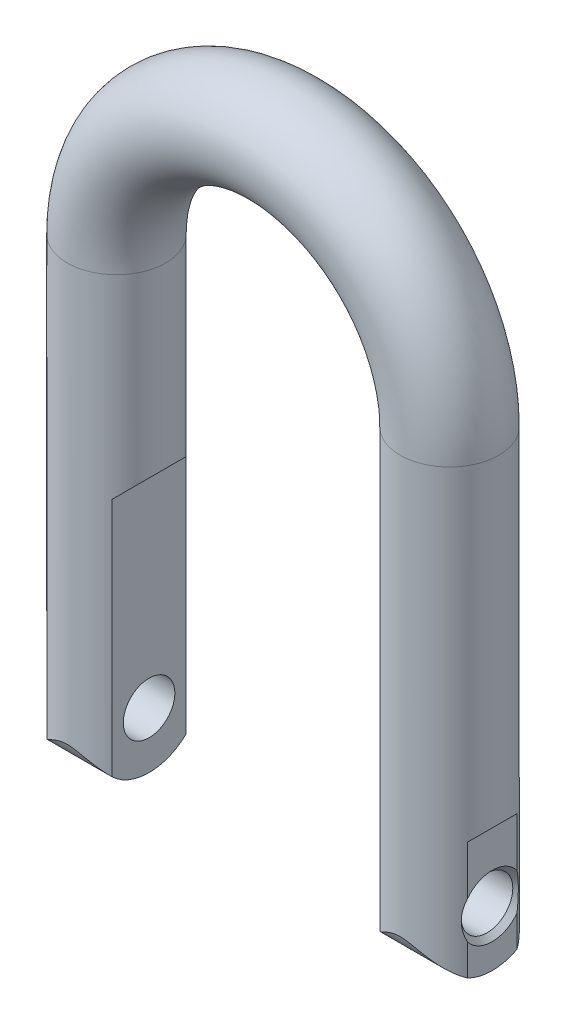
ISO-10303-21;
HEADER;
FILE_DESCRIPTION(('STEP AP214'),'2;1');
FILE_NAME('part.step','',(''),(''),'','','');
FILE_SCHEMA(('AUTOMOTIVE_DESIGN { 1 0 10303 214 1 1 1 1 }'));
ENDSEC;
DATA;
#1=APPLICATION_CONTEXT('core data for automotive mechanical design processes');
#2=APPLICATION_PROTOCOL_DEFINITION('international standard','automotive_design',2000,#1);
#3=PRODUCT_CONTEXT('',#1,'mechanical');
#4=PRODUCT('Part','Part','',(#3));
#5=PRODUCT_RELATED_PRODUCT_CATEGORY('part','',(#4));
#6=PRODUCT_DEFINITION_FORMATION('','',#4);
#7=PRODUCT_DEFINITION_CONTEXT('part definition',#1,'design');
#8=PRODUCT_DEFINITION('design','',#6,#7);
#9=PRODUCT_DEFINITION_SHAPE('','',#8);
#10=(LENGTH_UNIT() NAMED_UNIT(*) SI_UNIT(.MILLI.,.METRE.));
#11=(NAMED_UNIT(*) PLANE_ANGLE_UNIT() SI_UNIT($,.RADIAN.));
#12=(NAMED_UNIT(*) SI_UNIT($,.STERADIAN.) SOLID_ANGLE_UNIT());
#13=UNCERTAINTY_MEASURE_WITH_UNIT(LENGTH_MEASURE(1.E-05),#10,'distance_accuracy_value','');
#14=(GEOMETRIC_REPRESENTATION_CONTEXT(3) GLOBAL_UNCERTAINTY_ASSIGNED_CONTEXT((#13)) GLOBAL_UNIT_ASSIGNED_CONTEXT((#10,
#11,#12)) REPRESENTATION_CONTEXT('',''));
#15=CARTESIAN_POINT('',(0.,0.,0.));
#16=DIRECTION('',(0.,0.,1.));
#17=DIRECTION('',(1.,0.,0.));
#18=AXIS2_PLACEMENT_3D('',#15,#16,#17);
#19=CARTESIAN_POINT('',(20.193,-31.4833,-76.2));
#20=DIRECTION('',(-1.,0.,0.));
#21=DIRECTION('',(0.,-1.,0.));
#22=AXIS2_PLACEMENT_3D('',#19,#20,#21);
#23=PLANE('',#22);
#24=DIRECTION('',(0.,-1.,0.));
#25=VECTOR('',#24,1.);
#26=CARTESIAN_POINT('',(20.193,0.,2.39787973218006));
#27=LINE('',#26,#25);
#28=CARTESIAN_POINT('',(20.193,-31.4833,2.39787973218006));
#29=VERTEX_POINT('',#28);
#30=CARTESIAN_POINT('',(20.193,-36.2341889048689,2.39787973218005));
#31=VERTEX_POINT('',#30);
#32=EDGE_CURVE('E264',#29,#31,#27,.T.);
#33=ORIENTED_EDGE('',*,*,#32,.T.);
#34=CARTESIAN_POINT('',(20.193,-38.0111,0.));
#35=DIRECTION('',(1.,0.,0.));
#36=DIRECTION('',(0.,0.,-1.));
#37=AXIS2_PLACEMENT_3D('',#34,#35,#36);
#38=CIRCLE('',#37,2.9845);
#39=CARTESIAN_POINT('',(20.193,-36.2341889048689,-2.39787973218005));
#40=VERTEX_POINT('',#39);
#41=EDGE_CURVE('E265',#40,#31,#38,.T.);
#42=ORIENTED_EDGE('',*,*,#41,.F.);
#43=DIRECTION('',(0.,-1.,0.));
#44=VECTOR('',#43,1.);
#45=CARTESIAN_POINT('',(20.193,0.,-2.39787973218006));
#46=LINE('',#45,#44);
#47=CARTESIAN_POINT('',(20.193,-31.4833,-2.39787973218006));
#48=VERTEX_POINT('',#47);
#49=EDGE_CURVE('E272',#40,#48,#46,.F.);
#50=ORIENTED_EDGE('',*,*,#49,.T.);
#51=DIRECTION('',(0.,0.,1.));
#52=VECTOR('',#51,1.);
#53=CARTESIAN_POINT('',(20.193,-31.4833,-76.2));
#54=LINE('',#53,#52);
#55=EDGE_CURVE('E268',#48,#29,#54,.T.);
#56=ORIENTED_EDGE('',*,*,#55,.T.);
#57=EDGE_LOOP('',(#33,#42,#50,#56));
#58=FACE_BOUND('',#57,.T.);
#59=ADVANCED_FACE('F29',(#58),#23,.F.);
#60=CARTESIAN_POINT('',(-20.193,-31.4833,-76.2));
#61=DIRECTION('',(1.,0.,0.));
#62=DIRECTION('',(0.,0.,-1.));
#63=AXIS2_PLACEMENT_3D('',#60,#61,#62);
#64=PLANE('',#63);
#65=DIRECTION('',(0.,-1.,0.));
#66=VECTOR('',#65,1.);
#67=CARTESIAN_POINT('',(-20.193,0.,-2.39787973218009));
#68=LINE('',#67,#66);
#69=CARTESIAN_POINT('',(-20.193,-37.3430510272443,-2.39787973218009));
#70=VERTEX_POINT('',#69);
#71=CARTESIAN_POINT('',(-20.193,-31.4833,-2.39787973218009));
#72=VERTEX_POINT('',#71);
#73=EDGE_CURVE('E148',#70,#72,#68,.F.);
#74=ORIENTED_EDGE('',*,*,#73,.F.);
#75=CARTESIAN_POINT('',(-20.193,-38.0111,0.));
#76=DIRECTION('',(1.,0.,0.));
#77=DIRECTION('',(0.,0.,-1.));
#78=AXIS2_PLACEMENT_3D('',#75,#76,#77);
#79=CIRCLE('',#78,2.4892);
#80=CARTESIAN_POINT('',(-20.193,-37.3430510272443,2.39787973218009));
#81=VERTEX_POINT('',#80);
#82=EDGE_CURVE('E128',#70,#81,#79,.T.);
#83=ORIENTED_EDGE('',*,*,#82,.T.);
#84=DIRECTION('',(0.,-1.,0.));
#85=VECTOR('',#84,1.);
#86=CARTESIAN_POINT('',(-20.193,0.,2.39787973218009));
#87=LINE('',#86,#85);
#88=CARTESIAN_POINT('',(-20.193,-31.4833,2.39787973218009));
#89=VERTEX_POINT('',#88);
#90=EDGE_CURVE('E138',#89,#81,#87,.T.);
#91=ORIENTED_EDGE('',*,*,#90,.F.);
#92=DIRECTION('',(0.,0.,1.));
#93=VECTOR('',#92,1.);
#94=CARTESIAN_POINT('',(-20.193,-31.4833,-76.2));
#95=LINE('',#94,#93);
#96=EDGE_CURVE('E280',#72,#89,#95,.T.);
#97=ORIENTED_EDGE('',*,*,#96,.F.);
#98=EDGE_LOOP('',(#74,#83,#91,#97));
#99=FACE_BOUND('',#98,.T.);
#100=ADVANCED_FACE('F235',(#99),#64,.F.);
#101=CARTESIAN_POINT('',(16.0782,0.,0.));
#102=DIRECTION('',(0.,-1.,0.));
#103=DIRECTION('',(1.,0.,0.));
#104=AXIS2_PLACEMENT_3D('',#101,#102,#103);
#105=CYLINDRICAL_SURFACE('',#104,4.7625);
#106=CARTESIAN_POINT('',(20.4463472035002,-35.3875607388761,1.89755006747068));
#107=CARTESIAN_POINT('',(20.4242410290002,-35.4516474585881,1.94842537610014));
#108=CARTESIAN_POINT('',(20.4021202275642,-35.5175683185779,1.99692815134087));
#109=CARTESIAN_POINT('',(20.3582674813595,-35.6526684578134,2.08927063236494));
#110=CARTESIAN_POINT('',(20.3365353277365,-35.7218459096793,2.13311290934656));
#111=CARTESIAN_POINT('',(20.2724434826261,-35.9339830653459,2.25798432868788));
#112=CARTESIAN_POINT('',(20.2312610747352,-36.0813420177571,2.33219741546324));
#113=CARTESIAN_POINT('',(20.1417011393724,-36.4391198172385,2.48594409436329));
#114=CARTESIAN_POINT('',(20.0959167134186,-36.6534341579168,2.55810545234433));
#115=CARTESIAN_POINT('',(20.0409778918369,-36.9831686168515,2.64175388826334));
#116=CARTESIAN_POINT('',(20.0249501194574,-37.0945136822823,2.66554336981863));
#117=CARTESIAN_POINT('',(19.9981198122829,-37.3193048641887,2.70485039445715));
#118=CARTESIAN_POINT('',(19.9873168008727,-37.4327507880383,2.72036869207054));
#119=CARTESIAN_POINT('',(19.9715199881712,-37.6597444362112,2.74292749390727));
#120=CARTESIAN_POINT('',(19.9664700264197,-37.7732801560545,2.75004998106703));
#121=CARTESIAN_POINT('',(19.9622209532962,-38.0006870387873,2.7560482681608));
#122=CARTESIAN_POINT('',(19.9630221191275,-38.1145582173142,2.75492367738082));
#123=CARTESIAN_POINT('',(19.9704361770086,-38.3416036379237,2.74443894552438));
#124=CARTESIAN_POINT('',(19.9770425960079,-38.4547785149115,2.73508797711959));
#125=CARTESIAN_POINT('',(19.995745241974,-38.6796590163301,2.70822959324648));
#126=CARTESIAN_POINT('',(20.0078404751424,-38.7913649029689,2.69072365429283));
#127=CARTESIAN_POINT('',(20.0426244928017,-39.0551965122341,2.63933032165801));
#128=CARTESIAN_POINT('',(20.0675992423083,-39.2063168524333,2.60173028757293));
#129=CARTESIAN_POINT('',(20.1252066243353,-39.5025405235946,2.511175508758));
#130=CARTESIAN_POINT('',(20.1578499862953,-39.6476350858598,2.45819922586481));
#131=CARTESIAN_POINT('',(20.2431410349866,-39.9882560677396,2.31183470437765));
#132=CARTESIAN_POINT('',(20.2984842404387,-40.1798789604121,2.21079163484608));
#133=CARTESIAN_POINT('',(20.412844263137,-40.54123031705,1.9771462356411));
#134=CARTESIAN_POINT('',(20.4718488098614,-40.7110266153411,1.84464551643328));
#135=CARTESIAN_POINT('',(20.5501235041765,-40.9241143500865,1.63918948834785));
#136=CARTESIAN_POINT('',(20.5713200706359,-40.9804998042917,1.58033562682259));
#137=CARTESIAN_POINT('',(20.6125679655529,-41.0882437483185,1.45776982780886));
#138=CARTESIAN_POINT('',(20.632618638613,-41.1395993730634,1.39405515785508));
#139=CARTESIAN_POINT('',(20.6518347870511,-41.1880928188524,1.32788218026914));
#140=B_SPLINE_CURVE_WITH_KNOTS('',3,(#106,#107,#108,#109,#110,#111,#112,#113,#114,#115,#116,
#117,#118,#119,#120,#121,#122,#123,#124,#125,#126,#127,#128,#129,#130,#131,#132,#133,#134,#135,
#136,#137,#138,#139),.UNSPECIFIED.,.F.,.F.,(4,2,2,2,2,2,2,2,2,2,2,2,2,2,2,2,4),(0.,
0.254168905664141,0.508196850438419,1.01705863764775,1.70557840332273,2.05017516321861,
2.39474048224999,2.73591257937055,3.07710083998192,3.41790914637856,3.75865577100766,
4.23066016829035,4.70332893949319,5.37109579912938,6.03673438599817,6.2891290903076,
6.54166673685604),.UNSPECIFIED.);
#141=CARTESIAN_POINT('',(20.193,-39.7880110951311,2.39787973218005));
#142=VERTEX_POINT('',#141);
#143=EDGE_CURVE('E11',#31,#142,#140,.T.);
#144=ORIENTED_EDGE('',*,*,#143,.F.);
#145=ORIENTED_EDGE('',*,*,#32,.F.);
#146=CARTESIAN_POINT('',(16.0782,-35.5981,0.));
#147=DIRECTION('',(-0.707106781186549,0.707106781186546,0.));
#148=DIRECTION('',(-0.707106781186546,-0.707106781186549,0.));
#149=AXIS2_PLACEMENT_3D('',#146,#147,#148);
#150=ELLIPSE('',#149,6.73519209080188,4.7625);
#151=EDGE_CURVE('E129',#48,#29,#150,.F.);
#152=ORIENTED_EDGE('',*,*,#151,.F.);
#153=ORIENTED_EDGE('',*,*,#49,.F.);
#154=CARTESIAN_POINT('',(20.6518347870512,-41.1880928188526,-1.32788218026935));
#155=CARTESIAN_POINT('',(20.632224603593,-41.1386036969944,-1.39540495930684));
#156=CARTESIAN_POINT('',(20.6117492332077,-41.0861457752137,-1.46036611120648));
#157=CARTESIAN_POINT('',(20.5696203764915,-40.9760167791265,-1.58521241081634));
#158=CARTESIAN_POINT('',(20.5479678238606,-40.9183498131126,-1.64510148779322));
#159=CARTESIAN_POINT('',(20.482337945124,-40.7393558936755,-1.81656037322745));
#160=CARTESIAN_POINT('',(20.4373921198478,-40.6113070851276,-1.92088562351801));
#161=CARTESIAN_POINT('',(20.3823503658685,-40.4438923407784,-2.03871061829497));
#162=CARTESIAN_POINT('',(20.3716097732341,-40.4107100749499,-2.06122111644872));
#163=CARTESIAN_POINT('',(20.3314239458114,-40.2844241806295,-2.14383990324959));
#164=CARTESIAN_POINT('',(20.3023647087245,-40.1887518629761,-2.20031307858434));
#165=CARTESIAN_POINT('',(20.2461284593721,-39.9923916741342,-2.30506118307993));
#166=CARTESIAN_POINT('',(20.2189544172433,-39.89169629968,-2.35332334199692));
#167=CARTESIAN_POINT('',(20.1417421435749,-39.5832410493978,-2.4858752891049));
#168=CARTESIAN_POINT('',(20.0959515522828,-39.368925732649,-2.55805010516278));
#169=CARTESIAN_POINT('',(20.040999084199,-39.0391833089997,-2.64172274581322));
#170=CARTESIAN_POINT('',(20.0249619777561,-38.9277832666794,-2.66552604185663));
#171=CARTESIAN_POINT('',(19.9981227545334,-38.702922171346,-2.70484604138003));
#172=CARTESIAN_POINT('',(19.9873178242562,-38.5894622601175,-2.72036719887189));
#173=CARTESIAN_POINT('',(19.9715218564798,-38.3624840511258,-2.74292485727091));
#174=CARTESIAN_POINT('',(19.9664725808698,-38.2489781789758,-2.75004637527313));
#175=CARTESIAN_POINT('',(19.9622216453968,-38.0216283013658,-2.75604729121));
#176=CARTESIAN_POINT('',(19.9630203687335,-37.9077842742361,-2.75492614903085));
#177=CARTESIAN_POINT('',(19.9704286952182,-37.6807367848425,-2.74444952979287));
#178=CARTESIAN_POINT('',(19.9770346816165,-37.5675329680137,-2.73509917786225));
#179=CARTESIAN_POINT('',(19.9957393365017,-37.3425956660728,-2.70823823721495));
#180=CARTESIAN_POINT('',(20.0078369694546,-37.2308619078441,-2.6907291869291));
#181=CARTESIAN_POINT('',(20.0426459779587,-36.9668402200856,-2.63929808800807));
#182=CARTESIAN_POINT('',(20.0676521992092,-36.8155621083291,-2.60164839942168));
#183=CARTESIAN_POINT('',(20.1252768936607,-36.5193471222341,-2.51106371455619));
#184=CARTESIAN_POINT('',(20.1578898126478,-36.3744057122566,-2.45813986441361));
#185=CARTESIAN_POINT('',(20.231195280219,-36.0816510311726,-2.33232466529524));
#186=CARTESIAN_POINT('',(20.2723136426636,-35.9344575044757,-2.25822096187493));
#187=CARTESIAN_POINT('',(20.3363690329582,-35.7223741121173,-2.13344501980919));
#188=CARTESIAN_POINT('',(20.3581359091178,-35.653077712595,-2.08954149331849));
#189=CARTESIAN_POINT('',(20.4020554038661,-35.5177641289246,-1.9970708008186));
#190=CARTESIAN_POINT('',(20.4242081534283,-35.4517480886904,-1.94850202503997));
#191=CARTESIAN_POINT('',(20.4463472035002,-35.3875607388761,-1.89755006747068));
#192=B_SPLINE_CURVE_WITH_KNOTS('',3,(#154,#155,#156,#157,#158,#159,#160,#161,#162,#163,#164,
#165,#166,#167,#168,#169,#170,#171,#172,#173,#174,#175,#176,#177,#178,#179,#180,#181,#182,#183,
#184,#185,#186,#187,#188,#189,#190,#191),.UNSPECIFIED.,.F.,.F.,(4,2,2,2,2,2,2,2,2,2,2,2,2,2,2,2,
2,2,4),(0.,0.257678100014,0.51515471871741,1.02641734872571,1.1509539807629,1.49491024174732,
1.8393966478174,2.52768758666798,2.87247614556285,3.21707909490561,3.55816336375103,
3.89926998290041,4.2401643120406,4.58099438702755,5.05350293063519,5.52566753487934,
6.03373695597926,6.28818808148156,6.54272732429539),.UNSPECIFIED.);
#193=CARTESIAN_POINT('',(20.193,-39.7880110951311,-2.39787973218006));
#194=VERTEX_POINT('',#193);
#195=EDGE_CURVE('E42',#194,#40,#192,.T.);
#196=ORIENTED_EDGE('',*,*,#195,.F.);
#197=CARTESIAN_POINT('',(20.193,-42.8301382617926,-2.39787973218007));
#198=VERTEX_POINT('',#197);
#199=EDGE_CURVE('E275',#198,#194,#46,.F.);
#200=ORIENTED_EDGE('',*,*,#199,.F.);
#201=CARTESIAN_POINT('',(20.8407,-43.4213,0.));
#202=CARTESIAN_POINT('',(20.8407031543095,-43.4213031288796,0.109435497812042));
#203=CARTESIAN_POINT('',(20.8369233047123,-43.4178128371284,0.21884290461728));
#204=CARTESIAN_POINT('',(20.8218888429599,-43.4039379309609,0.436739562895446));
#205=CARTESIAN_POINT('',(20.8106324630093,-43.3935516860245,0.545228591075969));
#206=CARTESIAN_POINT('',(20.7808572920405,-43.366102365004,0.760415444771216));
#207=CARTESIAN_POINT('',(20.762333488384,-43.3490346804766,0.867111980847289));
#208=CARTESIAN_POINT('',(20.7183676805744,-43.3085756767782,1.07789000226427));
#209=CARTESIAN_POINT('',(20.6929225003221,-43.285181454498,1.18197026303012));
#210=CARTESIAN_POINT('',(20.6357606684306,-43.2327132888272,1.38607316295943));
#211=CARTESIAN_POINT('',(20.6040897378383,-43.2036807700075,1.4861193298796));
#212=CARTESIAN_POINT('',(20.5348407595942,-43.1403303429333,1.68244041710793));
#213=CARTESIAN_POINT('',(20.4972605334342,-43.1060104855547,1.77871393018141));
#214=CARTESIAN_POINT('',(20.3764273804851,-42.9959357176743,2.06120238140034));
#215=CARTESIAN_POINT('',(20.2850451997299,-42.9130316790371,2.24121326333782));
#216=CARTESIAN_POINT('',(20.0439931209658,-42.6959441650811,2.65164135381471));
#217=CARTESIAN_POINT('',(19.8856712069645,-42.5545560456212,2.8731576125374));
#218=CARTESIAN_POINT('',(19.6281454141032,-42.3284714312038,3.17758717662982));
#219=CARTESIAN_POINT('',(19.5388075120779,-42.2506434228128,3.2745526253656));
#220=CARTESIAN_POINT('',(19.3540498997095,-42.0914214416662,3.45937390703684));
#221=CARTESIAN_POINT('',(19.2586309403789,-42.0100279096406,3.54723086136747));
#222=CARTESIAN_POINT('',(19.0598006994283,-41.8428066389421,3.71603299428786));
#223=CARTESIAN_POINT('',(18.9562500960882,-41.7569190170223,3.79675342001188));
#224=CARTESIAN_POINT('',(18.7435463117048,-41.5839190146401,3.94897968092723));
#225=CARTESIAN_POINT('',(18.6343928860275,-41.4968065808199,4.02048511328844));
#226=CARTESIAN_POINT('',(18.4106239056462,-41.3230209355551,4.15429628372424));
#227=CARTESIAN_POINT('',(18.2960181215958,-41.2363472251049,4.21661771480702));
#228=CARTESIAN_POINT('',(18.060769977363,-41.0652793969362,4.33220470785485));
#229=CARTESIAN_POINT('',(17.9401306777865,-40.9808841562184,4.38547480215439));
#230=CARTESIAN_POINT('',(17.6952914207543,-40.8194948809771,4.4814324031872));
#231=CARTESIAN_POINT('',(17.5712858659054,-40.7423597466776,4.52437454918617));
#232=CARTESIAN_POINT('',(17.3151422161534,-40.5970952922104,4.60100608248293));
#233=CARTESIAN_POINT('',(17.1830026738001,-40.5289675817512,4.63469381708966));
#234=CARTESIAN_POINT('',(16.9311845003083,-40.4185155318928,4.68695866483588));
#235=CARTESIAN_POINT('',(16.8129142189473,-40.3738041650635,4.70709385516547));
#236=CARTESIAN_POINT('',(16.5700923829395,-40.3021387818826,4.73859627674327));
#237=CARTESIAN_POINT('',(16.4455646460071,-40.2751222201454,4.74999441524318));
#238=CARTESIAN_POINT('',(16.2120545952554,-40.2469495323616,4.76182828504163));
#239=CARTESIAN_POINT('',(16.1035561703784,-40.2425110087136,4.76365667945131));
#240=CARTESIAN_POINT('',(15.8874335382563,-40.2515041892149,4.75990696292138));
#241=CARTESIAN_POINT('',(15.7798097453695,-40.264943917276,4.75432552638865));
#242=CARTESIAN_POINT('',(15.5341157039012,-40.3139862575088,4.73340622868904));
#243=CARTESIAN_POINT('',(15.3974640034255,-40.3553537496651,4.71549550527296));
#244=CARTESIAN_POINT('',(15.132430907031,-40.4558233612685,4.66960479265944));
#245=CARTESIAN_POINT('',(15.0040906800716,-40.5150066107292,4.64157862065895));
#246=CARTESIAN_POINT('',(14.7554231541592,-40.6436683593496,4.57691159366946));
#247=CARTESIAN_POINT('',(14.635083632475,-40.7131306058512,4.54028428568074));
#248=CARTESIAN_POINT('',(14.4007852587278,-40.8580257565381,4.45904405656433));
#249=CARTESIAN_POINT('',(14.2868328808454,-40.9334645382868,4.41442321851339));
#250=CARTESIAN_POINT('',(14.0642868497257,-41.0875563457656,4.31744182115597));
#251=CARTESIAN_POINT('',(13.9557013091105,-41.1662139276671,4.26506999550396));
#252=CARTESIAN_POINT('',(13.7435407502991,-41.3247275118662,4.15273067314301));
#253=CARTESIAN_POINT('',(13.6399639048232,-41.4045830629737,4.09276597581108));
#254=CARTESIAN_POINT('',(13.4239023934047,-41.5748840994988,3.95658076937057));
#255=CARTESIAN_POINT('',(13.3120915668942,-41.6653103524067,3.87925864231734));
#256=CARTESIAN_POINT('',(13.0946008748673,-41.8443572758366,3.71458676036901));
#257=CARTESIAN_POINT('',(12.9889224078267,-41.9329775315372,3.62723473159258));
#258=CARTESIAN_POINT('',(12.681960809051,-42.1936998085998,3.3500564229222));
#259=CARTESIAN_POINT('',(12.4901343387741,-42.3611631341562,3.14472343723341));
#260=CARTESIAN_POINT('',(12.1792885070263,-42.6362154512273,2.74383515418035));
#261=CARTESIAN_POINT('',(12.053651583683,-42.7487385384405,2.556784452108));
#262=CARTESIAN_POINT('',(11.8266518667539,-42.9534475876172,2.15828195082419));
#263=CARTESIAN_POINT('',(11.7252619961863,-43.0456562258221,1.94685776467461));
#264=CARTESIAN_POINT('',(11.566419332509,-43.190692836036,1.53794751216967));
#265=CARTESIAN_POINT('',(11.5045375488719,-43.2474565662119,1.34361889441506));
#266=CARTESIAN_POINT('',(11.4303489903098,-43.3156401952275,1.04380892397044));
#267=CARTESIAN_POINT('',(11.4087221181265,-43.3355438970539,0.942460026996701));
#268=CARTESIAN_POINT('',(11.3720190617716,-43.369347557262,0.737613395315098));
#269=CARTESIAN_POINT('',(11.3569402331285,-43.3832499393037,0.634116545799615));
#270=CARTESIAN_POINT('',(11.3335523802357,-43.4048214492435,0.425233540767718));
#271=CARTESIAN_POINT('',(11.3252745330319,-43.4124618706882,0.319840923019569));
#272=CARTESIAN_POINT('',(11.3157620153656,-43.4212424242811,0.108508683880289));
#273=CARTESIAN_POINT('',(11.3145245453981,-43.4223851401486,0.00256929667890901));
#274=CARTESIAN_POINT('',(11.3191137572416,-43.4181485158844,-0.209050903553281));
#275=CARTESIAN_POINT('',(11.3249418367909,-43.4127678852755,-0.314731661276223));
#276=CARTESIAN_POINT('',(11.3435394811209,-43.3956088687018,-0.52492545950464));
#277=CARTESIAN_POINT('',(11.3563087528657,-43.3838307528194,-0.629438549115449));
#278=CARTESIAN_POINT('',(11.4026019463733,-43.3411684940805,-0.926520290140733));
#279=CARTESIAN_POINT('',(11.4445201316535,-43.3025743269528,-1.11677209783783));
#280=CARTESIAN_POINT('',(11.5494402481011,-43.2062858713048,-1.48617340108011));
#281=CARTESIAN_POINT('',(11.6124491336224,-43.1485852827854,-1.66531921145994));
#282=CARTESIAN_POINT('',(11.7330495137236,-43.0386595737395,-1.9537016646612));
#283=CARTESIAN_POINT('',(11.7857319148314,-42.9907625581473,-2.06671759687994));
#284=CARTESIAN_POINT('',(11.8984270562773,-42.888695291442,-2.28606966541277));
#285=CARTESIAN_POINT('',(11.958441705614,-42.8345234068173,-2.39240405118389));
#286=CARTESIAN_POINT('',(12.1484415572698,-42.6638162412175,-2.70127241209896));
#287=CARTESIAN_POINT('',(12.2882801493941,-42.5391836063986,-2.89343321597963));
#288=CARTESIAN_POINT('',(12.5383154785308,-42.3196157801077,-3.18978569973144));
#289=CARTESIAN_POINT('',(12.6428559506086,-42.2286288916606,-3.30194968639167));
#290=CARTESIAN_POINT('',(12.8600543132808,-42.0420507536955,-3.51396546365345));
#291=CARTESIAN_POINT('',(12.9727123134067,-41.9464594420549,-3.61381708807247));
#292=CARTESIAN_POINT('',(13.2055151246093,-41.7524542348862,-3.80151013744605));
#293=CARTESIAN_POINT('',(13.3256660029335,-41.6540380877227,-3.88934164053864));
#294=CARTESIAN_POINT('',(13.5731307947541,-41.4564566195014,-4.05315378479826));
#295=CARTESIAN_POINT('',(13.7004417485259,-41.3572916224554,-4.12913927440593));
#296=CARTESIAN_POINT('',(13.9138109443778,-41.1973225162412,-4.2432916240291));
#297=CARTESIAN_POINT('',(13.9975859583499,-41.1359785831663,-4.28500783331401));
#298=CARTESIAN_POINT('',(14.1683629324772,-41.0148385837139,-4.36380277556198));
#299=CARTESIAN_POINT('',(14.2553642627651,-40.9550422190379,-4.40088240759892));
#300=CARTESIAN_POINT('',(14.4328695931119,-40.838184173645,-4.47027583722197));
#301=CARTESIAN_POINT('',(14.5233688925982,-40.7811190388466,-4.50259576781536));
#302=CARTESIAN_POINT('',(14.7084584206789,-40.6712612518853,-4.56230906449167));
#303=CARTESIAN_POINT('',(14.8030465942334,-40.6184664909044,-4.58970487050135));
#304=CARTESIAN_POINT('',(15.0137624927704,-40.5108074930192,-4.64350933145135));
#305=CARTESIAN_POINT('',(15.1307872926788,-40.4571629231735,-4.6689288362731));
#306=CARTESIAN_POINT('',(15.3718860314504,-40.3644184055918,-4.71141302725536));
#307=CARTESIAN_POINT('',(15.4959415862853,-40.3252823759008,-4.72849847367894));
#308=CARTESIAN_POINT('',(15.7271723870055,-40.273567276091,-4.75069660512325));
#309=CARTESIAN_POINT('',(15.8333748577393,-40.2574796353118,-4.75740910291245));
#310=CARTESIAN_POINT('',(16.0471548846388,-40.2426715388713,-4.76359508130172));
#311=CARTESIAN_POINT('',(16.1547307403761,-40.2439313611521,-4.76307678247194));
#312=CARTESIAN_POINT('',(16.3676069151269,-40.2634843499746,-4.75489120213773));
#313=CARTESIAN_POINT('',(16.4729132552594,-40.2817246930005,-4.74724609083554));
#314=CARTESIAN_POINT('',(16.6795399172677,-40.3320246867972,-4.72553086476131));
#315=CARTESIAN_POINT('',(16.7808517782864,-40.3641121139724,-4.71144783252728));
#316=CARTESIAN_POINT('',(16.9737353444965,-40.4363969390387,-4.67851737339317));
#317=CARTESIAN_POINT('',(17.0655408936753,-40.4761122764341,-4.65994137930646));
#318=CARTESIAN_POINT('',(17.2451356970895,-40.5618423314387,-4.61824364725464));
#319=CARTESIAN_POINT('',(17.3329210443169,-40.6078630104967,-4.59511759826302));
#320=CARTESIAN_POINT('',(17.5051730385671,-40.7043491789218,-4.54458381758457));
#321=CARTESIAN_POINT('',(17.5896255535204,-40.7548311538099,-4.51715988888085));
#322=CARTESIAN_POINT('',(17.7553190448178,-40.8586663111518,-4.45829599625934));
#323=CARTESIAN_POINT('',(17.8365588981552,-40.9120204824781,-4.42685464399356));
#324=CARTESIAN_POINT('',(18.0640887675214,-41.0666850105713,-4.3316664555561));
#325=CARTESIAN_POINT('',(18.2069328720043,-41.1701847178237,-4.26318871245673));
#326=CARTESIAN_POINT('',(18.4842439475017,-41.3789679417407,-4.11305293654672));
#327=CARTESIAN_POINT('',(18.6187047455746,-41.4842527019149,-4.03138534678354));
#328=CARTESIAN_POINT('',(18.879351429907,-41.6935403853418,-3.85482631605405));
#329=CARTESIAN_POINT('',(19.0055489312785,-41.797544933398,-3.75995404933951));
#330=CARTESIAN_POINT('',(19.2494361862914,-42.0020172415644,-3.55666296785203));
#331=CARTESIAN_POINT('',(19.3671307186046,-42.1024869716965,-3.44825185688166));
#332=CARTESIAN_POINT('',(19.6463080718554,-42.3436818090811,-3.16328300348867));
#333=CARTESIAN_POINT('',(19.8024556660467,-42.4812004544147,-2.97860251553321));
#334=CARTESIAN_POINT('',(20.0896056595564,-42.7367455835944,-2.57884017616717));
#335=CARTESIAN_POINT('',(20.2206468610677,-42.8548021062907,-2.36380614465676));
#336=CARTESIAN_POINT('',(20.4277943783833,-43.0425873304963,-1.95053404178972));
#337=CARTESIAN_POINT('',(20.5096441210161,-43.1172584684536,-1.75748787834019));
#338=CARTESIAN_POINT('',(20.6137799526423,-43.2125586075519,-1.4564402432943));
#339=CARTESIAN_POINT('',(20.6453788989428,-43.2415348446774,-1.35420961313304));
#340=CARTESIAN_POINT('',(20.7019081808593,-43.2934389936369,-1.14643424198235));
#341=CARTESIAN_POINT('',(20.7268401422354,-43.3163683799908,-1.04089031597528));
#342=CARTESIAN_POINT('',(20.7786077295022,-43.3640187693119,-0.782026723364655));
#343=CARTESIAN_POINT('',(20.8018095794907,-43.385415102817,-0.627335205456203));
#344=CARTESIAN_POINT('',(20.8328542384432,-43.4140541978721,-0.31507659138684));
#345=CARTESIAN_POINT('',(20.8406954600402,-43.4212954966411,-0.157509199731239));
#346=CARTESIAN_POINT('',(20.8407,-43.4213,0.));
#347=B_SPLINE_CURVE_WITH_KNOTS('',3,(#201,#202,#203,#204,#205,#206,#207,#208,#209,#210,#211,
#212,#213,#214,#215,#216,#217,#218,#219,#220,#221,#222,#223,#224,#225,#226,#227,#228,#229,#230,
#231,#232,#233,#234,#235,#236,#237,#238,#239,#240,#241,#242,#243,#244,#245,#246,#247,#248,#249,
#250,#251,#252,#253,#254,#255,#256,#257,#258,#259,#260,#261,#262,#263,#264,#265,#266,#267,#268,
#269,#270,#271,#272,#273,#274,#275,#276,#277,#278,#279,#280,#281,#282,#283,#284,#285,#286,#287,
#288,#289,#290,#291,#292,#293,#294,#295,#296,#297,#298,#299,#300,#301,#302,#303,#304,#305,#306,
#307,#308,#309,#310,#311,#312,#313,#314,#315,#316,#317,#318,#319,#320,#321,#322,#323,#324,#325,
#326,#327,#328,#329,#330,#331,#332,#333,#334,#335,#336,#337,#338,#339,#340,#341,#342,#343,#344,
#345,#346),.UNSPECIFIED.,.T.,.F.,(4,2,2,2,2,2,2,2,2,2,2,2,2,2,2,2,2,2,2,2,2,2,2,2,2,2,2,2,2,2,2,
2,2,2,2,2,2,2,2,2,2,2,2,2,2,2,2,2,2,2,2,2,2,2,2,2,2,2,2,2,2,2,2,2,2,2,2,2,2,2,2,2,4),(0.,
0.328138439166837,0.656354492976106,0.984797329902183,1.31339113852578,1.63965634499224,
1.9660421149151,2.6184059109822,3.53352971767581,3.99252951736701,4.45147273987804,
4.92176944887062,5.39208670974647,5.86159076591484,6.33085902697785,6.78698218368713,
7.24318674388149,7.62610383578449,8.00766002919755,8.33174177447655,8.65596901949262,
9.08512434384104,9.51626431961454,9.94672974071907,10.377623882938,10.80915061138,
11.2405187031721,11.7298650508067,12.2193225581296,13.1956151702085,13.948617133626,
14.7007742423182,15.3329356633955,15.6491726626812,15.9652818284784,16.2828321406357,
16.6002561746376,16.9177430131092,17.2352164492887,17.8282785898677,18.4215364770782,
18.8217448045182,19.2220575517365,20.0235008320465,20.5578056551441,21.092117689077,
21.6268681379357,22.1613991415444,22.4969703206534,22.8324763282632,23.1675461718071,
23.5024495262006,23.8952413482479,24.2870496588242,24.6084478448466,24.9294806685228,
25.2495181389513,25.570200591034,25.8749526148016,26.1799947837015,26.4862154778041,
26.7925422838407,27.359426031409,27.9267223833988,28.4932034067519,29.059363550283,
29.8909144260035,30.7211695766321,31.3859779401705,31.7181874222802,32.0503158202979,
32.5225527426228,32.9948384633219),.UNSPECIFIED.);
#348=CARTESIAN_POINT('',(12.9286,-41.9842763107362,-3.57231382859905));
#349=VERTEX_POINT('',#348);
#350=EDGE_CURVE('E168',#349,#198,#347,.T.);
#351=ORIENTED_EDGE('',*,*,#350,.F.);
#352=DIRECTION('',(0.,-1.,0.));
#353=VECTOR('',#352,1.);
#354=CARTESIAN_POINT('',(12.9286,0.,-3.57231382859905));
#355=LINE('',#354,#353);
#356=CARTESIAN_POINT('',(12.9286,-18.7833,-3.57231382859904));
#357=VERTEX_POINT('',#356);
#358=EDGE_CURVE('E155',#357,#349,#355,.T.);
#359=ORIENTED_EDGE('',*,*,#358,.F.);
#360=CARTESIAN_POINT('',(16.0782,-21.9329,0.));
#361=DIRECTION('',(0.707106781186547,0.707106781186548,0.));
#362=DIRECTION('',(0.707106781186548,-0.707106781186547,0.));
#363=AXIS2_PLACEMENT_3D('',#360,#361,#362);
#364=ELLIPSE('',#363,6.73519209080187,4.7625);
#365=CARTESIAN_POINT('',(12.9286,-18.7833,3.57231382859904));
#366=VERTEX_POINT('',#365);
#367=EDGE_CURVE('E205',#366,#357,#364,.F.);
#368=ORIENTED_EDGE('',*,*,#367,.F.);
#369=DIRECTION('',(0.,-1.,0.));
#370=VECTOR('',#369,1.);
#371=CARTESIAN_POINT('',(12.9286,0.,3.57231382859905));
#372=LINE('',#371,#370);
#373=CARTESIAN_POINT('',(12.9286,-41.9842763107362,3.57231382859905));
#374=VERTEX_POINT('',#373);
#375=EDGE_CURVE('E159',#374,#366,#372,.F.);
#376=ORIENTED_EDGE('',*,*,#375,.F.);
#377=CARTESIAN_POINT('',(20.193,-42.8301382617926,2.39787973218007));
#378=VERTEX_POINT('',#377);
#379=EDGE_CURVE('E167',#378,#374,#347,.T.);
#380=ORIENTED_EDGE('',*,*,#379,.F.);
#381=EDGE_CURVE('E273',#142,#378,#27,.T.);
#382=ORIENTED_EDGE('',*,*,#381,.F.);
#383=EDGE_LOOP('',(#144,#145,#152,#153,#196,#200,#351,#359,#368,#376,#380,#382));
#384=FACE_BOUND('',#383,.T.);
#385=CARTESIAN_POINT('',(16.0782,0.,0.));
#386=DIRECTION('',(0.,-1.,0.));
#387=DIRECTION('',(0.,0.,1.));
#388=AXIS2_PLACEMENT_3D('',#385,#386,#387);
#389=CIRCLE('',#388,4.7625);
#390=CARTESIAN_POINT('',(20.8407,0.,0.));
#391=VERTEX_POINT('',#390);
#392=EDGE_CURVE('E196',#391,#391,#389,.T.);
#393=ORIENTED_EDGE('',*,*,#392,.T.);
#394=EDGE_LOOP('',(#393));
#395=FACE_BOUND('',#394,.T.);
#396=ADVANCED_FACE('F31',(#384,#395),#105,.T.);
#397=CARTESIAN_POINT('',(0.,0.,0.));
#398=DIRECTION('',(0.,0.,-1.));
#399=DIRECTION('',(-1.,0.,0.));
#400=AXIS2_PLACEMENT_3D('',#397,#398,#399);
#401=TOROIDAL_SURFACE('',#400,16.0782,4.7625);
#402=CARTESIAN_POINT('',(-16.0782,0.,0.));
#403=DIRECTION('',(0.,1.,0.));
#404=DIRECTION('',(0.,0.,1.));
#405=AXIS2_PLACEMENT_3D('',#402,#403,#404);
#406=CIRCLE('',#405,4.7625);
#407=CARTESIAN_POINT('',(-20.8407,0.,0.));
#408=VERTEX_POINT('',#407);
#409=EDGE_CURVE('E174',#408,#408,#406,.T.);
#410=CARTESIAN_POINT('',(0.,0.,0.));
#411=DIRECTION('',(0.,0.,-1.));
#412=DIRECTION('',(-1.,0.,0.));
#413=AXIS2_PLACEMENT_3D('',#410,#411,#412);
#414=CIRCLE('',#413,20.8407);
#415=EDGE_CURVE('',#408,#391,#414,.T.);
#416=ORIENTED_EDGE('',*,*,#409,.T.);
#417=ORIENTED_EDGE('',*,*,#392,.F.);
#418=ORIENTED_EDGE('',*,*,#415,.T.);
#419=ORIENTED_EDGE('',*,*,#415,.F.);
#420=EDGE_LOOP('',(#416,#418,#417,#419));
#421=FACE_BOUND('',#420,.T.);
#422=ADVANCED_FACE('F374',(#421),#401,.T.);
#423=CARTESIAN_POINT('',(-16.0782,0.,0.));
#424=DIRECTION('',(0.,-1.,0.));
#425=DIRECTION('',(0.,0.,-1.));
#426=AXIS2_PLACEMENT_3D('',#423,#424,#425);
#427=CYLINDRICAL_SURFACE('',#426,4.7625);
#428=ORIENTED_EDGE('',*,*,#90,.T.);
#429=CARTESIAN_POINT('',(-20.3454,-36.6982000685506,2.11480741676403));
#430=CARTESIAN_POINT('',(-20.328887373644,-36.7518780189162,2.14812570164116));
#431=CARTESIAN_POINT('',(-20.3128701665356,-36.8069131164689,2.17946478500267));
#432=CARTESIAN_POINT('',(-20.2822228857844,-36.9195556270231,2.23801012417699));
#433=CARTESIAN_POINT('',(-20.2675937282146,-36.9771647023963,2.26521365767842));
#434=CARTESIAN_POINT('',(-20.2263318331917,-37.1538893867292,2.34044959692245));
#435=CARTESIAN_POINT('',(-20.2024303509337,-37.2765730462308,2.38190173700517));
#436=CARTESIAN_POINT('',(-20.1650226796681,-37.5289785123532,2.44554411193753));
#437=CARTESIAN_POINT('',(-20.1515624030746,-37.658728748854,2.4676493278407));
#438=CARTESIAN_POINT('',(-20.1373280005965,-37.92047900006,2.4910021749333));
#439=CARTESIAN_POINT('',(-20.1365179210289,-38.0524715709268,2.49230891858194));
#440=CARTESIAN_POINT('',(-20.1471810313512,-38.3042762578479,2.47484739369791));
#441=CARTESIAN_POINT('',(-20.1577111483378,-38.4242422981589,2.45762052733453));
#442=CARTESIAN_POINT('',(-20.1881915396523,-38.6594641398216,2.40629463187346));
#443=CARTESIAN_POINT('',(-20.2081582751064,-38.7747113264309,2.37216611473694));
#444=CARTESIAN_POINT('',(-20.2478702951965,-38.9632347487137,2.30137871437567));
#445=CARTESIAN_POINT('',(-20.2657752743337,-39.038470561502,2.26876480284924));
#446=CARTESIAN_POINT('',(-20.3039917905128,-39.1845445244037,2.19675641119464));
#447=CARTESIAN_POINT('',(-20.3242921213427,-39.2554009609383,2.15739314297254));
#448=CARTESIAN_POINT('',(-20.3454,-39.3239999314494,2.11480741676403));
#449=B_SPLINE_CURVE_WITH_KNOTS('',3,(#429,#430,#431,#432,#433,#434,#435,#436,#437,#438,#439,
#440,#441,#442,#443,#444,#445,#446,#447,#448),.UNSPECIFIED.,.F.,.F.,(4,2,2,2,2,2,2,2,2,4),(0.,
0.19580795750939,0.391744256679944,0.784810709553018,1.17959592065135,1.57325889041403,
1.93654297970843,2.30046312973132,2.5518632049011,2.80213059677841),.UNSPECIFIED.);
#450=CARTESIAN_POINT('',(-20.193,-38.6791489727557,2.39787973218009));
#451=VERTEX_POINT('',#450);
#452=EDGE_CURVE('E123',#81,#451,#449,.T.);
#453=ORIENTED_EDGE('',*,*,#452,.T.);
#454=CARTESIAN_POINT('',(-20.193,-42.8301382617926,2.39787973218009));
#455=VERTEX_POINT('',#454);
#456=EDGE_CURVE('E135',#451,#455,#87,.T.);
#457=ORIENTED_EDGE('',*,*,#456,.T.);
#458=CARTESIAN_POINT('',(-16.0782,-40.2452834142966,-4.7625));
#459=CARTESIAN_POINT('',(-16.1441353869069,-40.245286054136,-4.762499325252));
#460=CARTESIAN_POINT('',(-16.2100902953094,-40.248597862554,-4.76112441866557));
#461=CARTESIAN_POINT('',(-16.3412745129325,-40.2615899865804,-4.75568323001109));
#462=CARTESIAN_POINT('',(-16.4065032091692,-40.2712753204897,-4.75161482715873));
#463=CARTESIAN_POINT('',(-16.60065355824,-40.3090317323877,-4.73553692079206));
#464=CARTESIAN_POINT('',(-16.7276022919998,-40.3457964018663,-4.71965616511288));
#465=CARTESIAN_POINT('',(-16.9444925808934,-40.4244866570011,-4.6840203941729));
#466=CARTESIAN_POINT('',(-17.036048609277,-40.4630991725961,-4.66608814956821));
#467=CARTESIAN_POINT('',(-17.2151932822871,-40.5467873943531,-4.62569652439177));
#468=CARTESIAN_POINT('',(-17.302778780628,-40.5918681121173,-4.60323362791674));
#469=CARTESIAN_POINT('',(-17.4745372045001,-40.6865632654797,-4.55408172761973));
#470=CARTESIAN_POINT('',(-17.5586993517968,-40.7361906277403,-4.5273805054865));
#471=CARTESIAN_POINT('',(-17.7238171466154,-40.838421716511,-4.4700091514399));
#472=CARTESIAN_POINT('',(-17.804771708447,-40.8910264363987,-4.43933769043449));
#473=CARTESIAN_POINT('',(-18.0321304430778,-41.0441052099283,-4.34616281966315));
#474=CARTESIAN_POINT('',(-18.1750548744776,-41.1469025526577,-4.27893805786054));
#475=CARTESIAN_POINT('',(-18.452531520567,-41.3545270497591,-4.13141967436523));
#476=CARTESIAN_POINT('',(-18.5870775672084,-41.4593556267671,-4.05111657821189));
#477=CARTESIAN_POINT('',(-18.8479831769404,-41.6679630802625,-3.87739941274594));
#478=CARTESIAN_POINT('',(-18.9743528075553,-41.7717431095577,-3.78400193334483));
#479=CARTESIAN_POINT('',(-19.2187021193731,-41.975978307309,-3.58379436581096));
#480=CARTESIAN_POINT('',(-19.3366863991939,-42.0764352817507,-3.47699171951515));
#481=CARTESIAN_POINT('',(-19.618934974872,-42.3197308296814,-3.19401760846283));
#482=CARTESIAN_POINT('',(-19.777713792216,-42.4593503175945,-3.00941484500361));
#483=CARTESIAN_POINT('',(-20.0699672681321,-42.7191258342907,-2.60928795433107));
#484=CARTESIAN_POINT('',(-20.2034858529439,-42.8393155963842,-2.39381867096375));
#485=CARTESIAN_POINT('',(-20.4144083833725,-43.0304042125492,-1.98014555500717));
#486=CARTESIAN_POINT('',(-20.4977023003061,-43.1063564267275,-1.78734918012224));
#487=CARTESIAN_POINT('',(-20.6040762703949,-43.2036679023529,-1.48634376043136));
#488=CARTESIAN_POINT('',(-20.6364462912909,-43.2333416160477,-1.38400958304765));
#489=CARTESIAN_POINT('',(-20.6944984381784,-43.2866290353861,-1.17594237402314));
#490=CARTESIAN_POINT('',(-20.7201835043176,-43.3102454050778,-1.07021085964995));
#491=CARTESIAN_POINT('',(-20.7645752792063,-43.3510990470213,-0.855236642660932));
#492=CARTESIAN_POINT('',(-20.7832292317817,-43.3682880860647,-0.745973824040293));
#493=CARTESIAN_POINT('',(-20.8129133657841,-43.3956555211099,-0.52559398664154));
#494=CARTESIAN_POINT('',(-20.8239470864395,-43.4058371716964,-0.414477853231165));
#495=CARTESIAN_POINT('',(-20.838168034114,-43.4189618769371,-0.191331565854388));
#496=CARTESIAN_POINT('',(-20.8413563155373,-43.4219059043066,-0.0793015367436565));
#497=CARTESIAN_POINT('',(-20.8398195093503,-43.4204871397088,0.144650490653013));
#498=CARTESIAN_POINT('',(-20.8350950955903,-43.4161249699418,0.256572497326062));
#499=CARTESIAN_POINT('',(-20.8187839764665,-43.401073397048,0.467075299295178));
#500=CARTESIAN_POINT('',(-20.8080062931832,-43.3911300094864,0.565773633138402));
#501=CARTESIAN_POINT('',(-20.7804482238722,-43.3657259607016,0.761619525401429));
#502=CARTESIAN_POINT('',(-20.763665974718,-43.3502635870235,0.858766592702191));
#503=CARTESIAN_POINT('',(-20.7046886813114,-43.2959829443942,1.14688162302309));
#504=CARTESIAN_POINT('',(-20.6538491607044,-43.2492582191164,1.33469543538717));
#505=CARTESIAN_POINT('',(-20.5294554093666,-43.1353634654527,1.7051545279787));
#506=CARTESIAN_POINT('',(-20.4550566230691,-43.0674348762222,1.88727360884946));
#507=CARTESIAN_POINT('',(-20.2878265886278,-42.9156163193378,2.23558111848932));
#508=CARTESIAN_POINT('',(-20.194987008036,-42.8317191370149,2.40176229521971));
#509=CARTESIAN_POINT('',(-19.9411149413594,-42.6040571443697,2.80012557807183));
#510=CARTESIAN_POINT('',(-19.7698714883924,-42.4519873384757,3.02114930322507));
#511=CARTESIAN_POINT('',(-19.4926327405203,-42.2106608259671,3.3229271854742));
#512=CARTESIAN_POINT('',(-19.3966198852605,-42.1278429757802,3.41871553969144));
#513=CARTESIAN_POINT('',(-19.1983516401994,-41.9590209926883,3.60057372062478));
#514=CARTESIAN_POINT('',(-19.0960973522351,-41.8730174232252,3.68664525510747));
#515=CARTESIAN_POINT('',(-18.8831594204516,-41.6969891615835,3.85125735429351));
#516=CARTESIAN_POINT('',(-18.7723292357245,-41.6069176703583,3.92955686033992));
#517=CARTESIAN_POINT('',(-18.5446016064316,-41.4263393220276,4.07635011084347));
#518=CARTESIAN_POINT('',(-18.4277018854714,-41.3358323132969,4.14484013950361));
#519=CARTESIAN_POINT('',(-18.1878457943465,-41.1565958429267,4.27190667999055));
#520=CARTESIAN_POINT('',(-18.0649047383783,-41.0678626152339,4.33050674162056));
#521=CARTESIAN_POINT('',(-17.8119400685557,-40.8947640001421,4.43784061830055));
#522=CARTESIAN_POINT('',(-17.681922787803,-40.810394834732,4.48658307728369));
#523=CARTESIAN_POINT('',(-17.4321178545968,-40.6616610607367,4.56760828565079));
#524=CARTESIAN_POINT('',(-17.3134622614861,-40.5961516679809,4.60124172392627));
#525=CARTESIAN_POINT('',(-17.0685505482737,-40.4762885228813,4.66009039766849));
#526=CARTESIAN_POINT('',(-16.9423020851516,-40.4219237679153,4.68531395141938));
#527=CARTESIAN_POINT('',(-16.704824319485,-40.3395314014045,4.72233838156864));
#528=CARTESIAN_POINT('',(-16.5949119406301,-40.3085405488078,4.73572786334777));
#529=CARTESIAN_POINT('',(-16.3710882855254,-40.2638279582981,4.75480283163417));
#530=CARTESIAN_POINT('',(-16.2571892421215,-40.2500574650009,4.76051007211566));
#531=CARTESIAN_POINT('',(-16.0279596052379,-40.2425988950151,4.76361975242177));
#532=CARTESIAN_POINT('',(-15.9126246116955,-40.2490187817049,4.76097754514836));
#533=CARTESIAN_POINT('',(-15.6849786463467,-40.2807262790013,4.7476170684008));
#534=CARTESIAN_POINT('',(-15.5726754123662,-40.30605816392,4.73687984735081));
#535=CARTESIAN_POINT('',(-15.301192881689,-40.3864435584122,4.70152848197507));
#536=CARTESIAN_POINT('',(-15.1451553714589,-40.4499058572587,4.67274113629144));
#537=CARTESIAN_POINT('',(-14.8441995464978,-40.5941578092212,4.60247001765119));
#538=CARTESIAN_POINT('',(-14.6993343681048,-40.6750240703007,4.56092975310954));
#539=CARTESIAN_POINT('',(-14.416334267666,-40.8471765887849,4.46567442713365));
#540=CARTESIAN_POINT('',(-14.2783730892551,-40.9386277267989,4.41174865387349));
#541=CARTESIAN_POINT('',(-14.010318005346,-41.1258009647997,4.29264407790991));
#542=CARTESIAN_POINT('',(-13.8802312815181,-41.2215268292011,4.227455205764));
#543=CARTESIAN_POINT('',(-13.6271250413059,-41.4141067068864,4.08590860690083));
#544=CARTESIAN_POINT('',(-13.5041069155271,-41.5109609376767,4.00954869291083));
#545=CARTESIAN_POINT('',(-13.2649936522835,-41.7035359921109,3.84555346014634));
#546=CARTESIAN_POINT('',(-13.1488953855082,-41.7992573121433,3.75792329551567));
#547=CARTESIAN_POINT('',(-12.9366620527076,-41.9770588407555,3.58174819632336));
#548=CARTESIAN_POINT('',(-12.8397598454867,-42.0594503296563,3.49444590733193));
#549=CARTESIAN_POINT('',(-12.652050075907,-42.2207666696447,3.31061574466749));
#550=CARTESIAN_POINT('',(-12.5612431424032,-42.2996911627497,3.21408692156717));
#551=CARTESIAN_POINT('',(-12.2992964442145,-42.5291950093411,2.91075756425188));
#552=CARTESIAN_POINT('',(-12.1380300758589,-42.6730158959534,2.68972392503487));
#553=CARTESIAN_POINT('',(-11.8861491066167,-42.8996179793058,2.26985628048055));
#554=CARTESIAN_POINT('',(-11.7879226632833,-42.9887011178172,2.07902829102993));
#555=CARTESIAN_POINT('',(-11.6589547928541,-43.1061750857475,1.77864632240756));
#556=CARTESIAN_POINT('',(-11.619017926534,-43.1426500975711,1.67612831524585));
#557=CARTESIAN_POINT('',(-11.545865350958,-43.209582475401,1.46684035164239));
#558=CARTESIAN_POINT('',(-11.5126467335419,-43.240042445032,1.36007225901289));
#559=CARTESIAN_POINT('',(-11.4532266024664,-43.2946004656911,1.14189610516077));
#560=CARTESIAN_POINT('',(-11.4270917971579,-43.3186380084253,1.03045462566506));
#561=CARTESIAN_POINT('',(-11.3827753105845,-43.3594345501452,0.804742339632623));
#562=CARTESIAN_POINT('',(-11.3645895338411,-43.3761972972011,0.690473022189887));
#563=CARTESIAN_POINT('',(-11.3365575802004,-43.4020478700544,0.460099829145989));
#564=CARTESIAN_POINT('',(-11.3267079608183,-43.4111388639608,0.343996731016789));
#565=CARTESIAN_POINT('',(-11.3155673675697,-43.4214219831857,0.111038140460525));
#566=CARTESIAN_POINT('',(-11.3142752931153,-43.422615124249,-0.00581725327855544));
#567=CARTESIAN_POINT('',(-11.3198777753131,-43.4174433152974,-0.223690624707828));
#568=CARTESIAN_POINT('',(-11.3257136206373,-43.4120557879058,-0.324761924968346));
#569=CARTESIAN_POINT('',(-11.3437462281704,-43.3954181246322,-0.525879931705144));
#570=CARTESIAN_POINT('',(-11.3559449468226,-43.3841661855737,-0.625926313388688));
#571=CARTESIAN_POINT('',(-11.3864934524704,-43.3560133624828,-0.824229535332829));
#572=CARTESIAN_POINT('',(-11.4048410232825,-43.3391145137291,-0.922487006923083));
#573=CARTESIAN_POINT('',(-11.4473921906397,-43.2999704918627,-1.11665630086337));
#574=CARTESIAN_POINT('',(-11.4715981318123,-43.2777231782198,-1.21256716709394));
#575=CARTESIAN_POINT('',(-11.5526377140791,-43.2033532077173,-1.49646790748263));
#576=CARTESIAN_POINT('',(-11.617824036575,-43.143666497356,-1.68019049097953));
#577=CARTESIAN_POINT('',(-11.7671629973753,-43.00758740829,-2.03302101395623));
#578=CARTESIAN_POINT('',(-11.8513249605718,-42.9311868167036,-2.20212171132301));
#579=CARTESIAN_POINT('',(-12.0117956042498,-42.7864924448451,-2.48289752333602));
#580=CARTESIAN_POINT('',(-12.0845728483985,-42.7211534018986,-2.59816964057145));
#581=CARTESIAN_POINT('',(-12.2377851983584,-42.584455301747,-2.81970925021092));
#582=CARTESIAN_POINT('',(-12.3182211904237,-42.513095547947,-2.92597569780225));
#583=CARTESIAN_POINT('',(-12.4859866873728,-42.3654367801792,-3.12967423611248));
#584=CARTESIAN_POINT('',(-12.5733302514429,-42.2891277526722,-3.22708739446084));
#585=CARTESIAN_POINT('',(-12.7540324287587,-42.13285993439,-3.4129332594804));
#586=CARTESIAN_POINT('',(-12.8473902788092,-42.0529016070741,-3.50136710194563));
#587=CARTESIAN_POINT('',(-13.041859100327,-41.8885479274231,-3.67139088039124));
#588=CARTESIAN_POINT('',(-13.1430998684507,-41.8040926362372,-3.75277388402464));
#589=CARTESIAN_POINT('',(-13.3510688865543,-41.6337425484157,-3.90651866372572));
#590=CARTESIAN_POINT('',(-13.4577974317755,-41.5478476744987,-3.97887995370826));
#591=CARTESIAN_POINT('',(-13.6766206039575,-41.3761059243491,-4.11465587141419));
#592=CARTESIAN_POINT('',(-13.7887096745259,-41.2902590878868,-4.17807950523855));
#593=CARTESIAN_POINT('',(-14.0186635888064,-41.1203347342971,-4.29609251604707));
#594=CARTESIAN_POINT('',(-14.1365260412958,-41.0362565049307,-4.3506855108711));
#595=CARTESIAN_POINT('',(-14.3917628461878,-40.8636057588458,-4.45627979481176));
#596=CARTESIAN_POINT('',(-14.5298786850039,-40.7755075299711,-4.50628016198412));
#597=CARTESIAN_POINT('',(-14.8161064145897,-40.609982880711,-4.59466446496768));
#598=CARTESIAN_POINT('',(-14.9642117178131,-40.5325495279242,-4.63305596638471));
#599=CARTESIAN_POINT('',(-15.231064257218,-40.4162966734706,-4.68796381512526));
#600=CARTESIAN_POINT('',(-15.3470274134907,-40.372691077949,-4.70758564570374));
#601=CARTESIAN_POINT('',(-15.5849875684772,-40.3025958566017,-4.73839273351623));
#602=CARTESIAN_POINT('',(-15.7069575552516,-40.2760360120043,-4.74961263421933));
#603=CARTESIAN_POINT('',(-15.8715055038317,-40.2556044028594,-4.75819216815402));
#604=CARTESIAN_POINT('',(-15.9127274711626,-40.2517474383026,-4.7598043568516));
#605=CARTESIAN_POINT('',(-15.9953637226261,-40.2465860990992,-4.76195849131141));
#606=CARTESIAN_POINT('',(-16.0367780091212,-40.2452817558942,-4.76250042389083));
#607=CARTESIAN_POINT('',(-16.0782,-40.2452834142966,-4.7625));
#608=B_SPLINE_CURVE_WITH_KNOTS('',3,(#458,#459,#460,#461,#462,#463,#464,#465,#466,#467,#468,
#469,#470,#471,#472,#473,#474,#475,#476,#477,#478,#479,#480,#481,#482,#483,#484,#485,#486,#487,
#488,#489,#490,#491,#492,#493,#494,#495,#496,#497,#498,#499,#500,#501,#502,#503,#504,#505,#506,
#507,#508,#509,#510,#511,#512,#513,#514,#515,#516,#517,#518,#519,#520,#521,#522,#523,#524,#525,
#526,#527,#528,#529,#530,#531,#532,#533,#534,#535,#536,#537,#538,#539,#540,#541,#542,#543,#544,
#545,#546,#547,#548,#549,#550,#551,#552,#553,#554,#555,#556,#557,#558,#559,#560,#561,#562,#563,
#564,#565,#566,#567,#568,#569,#570,#571,#572,#573,#574,#575,#576,#577,#578,#579,#580,#581,#582,
#583,#584,#585,#586,#587,#588,#589,#590,#591,#592,#593,#594,#595,#596,#597,#598,#599,#600,#601,
#602,#603,#604,#605,#606,#607),.UNSPECIFIED.,.T.,.F.,(4,2,2,2,2,2,2,2,2,2,2,2,2,2,2,2,2,2,2,2,2,
2,2,2,2,2,2,2,2,2,2,2,2,2,2,2,2,2,2,2,2,2,2,2,2,2,2,2,2,2,2,2,2,2,2,2,2,2,2,2,2,2,2,2,2,2,2,2,2,
2,2,2,2,2,4),(0.,0.197742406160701,0.395640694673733,0.792724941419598,1.09526329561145,
1.39803733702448,1.70170062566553,2.0054658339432,2.57002552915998,3.13499604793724,
3.69925713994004,4.26320635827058,5.10214056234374,5.93960221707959,6.60666528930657,
6.94038531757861,7.27395832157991,7.60998660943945,7.94585872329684,8.28168569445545,
8.61748406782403,8.91647194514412,9.21555267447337,9.81320122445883,10.4353119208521,
11.0577043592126,12.0068825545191,12.4833072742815,12.9596481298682,13.4478568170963,
13.9362499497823,14.4234631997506,14.9102473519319,15.3285874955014,15.7465126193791,
16.0901830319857,16.4328782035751,16.7774089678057,17.1227488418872,17.6325255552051,
18.1445938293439,18.6661206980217,19.1881162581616,19.7102141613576,20.232074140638,
20.6944540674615,21.1568816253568,22.078979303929,22.7732734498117,23.1206362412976,
23.4678483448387,23.8182247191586,24.1684203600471,24.5184713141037,24.868477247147,
25.1722561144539,25.4761284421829,25.7798913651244,26.0837760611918,26.6928665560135,
27.3022570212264,27.7551905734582,28.2081766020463,28.6621095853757,29.1159850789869,
29.5804134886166,30.044866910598,30.5088489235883,30.9726403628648,31.4858011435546,
31.9986267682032,32.3738663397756,32.7475500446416,32.8717744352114,32.9960003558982),.UNSPECIFIED.);
#609=CARTESIAN_POINT('',(-12.9286,-41.9842763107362,3.57231382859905));
#610=VERTEX_POINT('',#609);
#611=EDGE_CURVE('E195',#455,#610,#608,.T.);
#612=ORIENTED_EDGE('',*,*,#611,.T.);
#613=DIRECTION('',(0.,-1.,0.));
#614=VECTOR('',#613,1.);
#615=CARTESIAN_POINT('',(-12.9286,0.,3.57231382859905));
#616=LINE('',#615,#614);
#617=CARTESIAN_POINT('',(-12.9286,-18.7833,3.57231382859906));
#618=VERTEX_POINT('',#617);
#619=EDGE_CURVE('E161',#610,#618,#616,.F.);
#620=ORIENTED_EDGE('',*,*,#619,.T.);
#621=CARTESIAN_POINT('',(-16.0782,-21.9329,0.));
#622=DIRECTION('',(-0.707106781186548,0.707106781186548,0.));
#623=DIRECTION('',(-0.707106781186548,-0.707106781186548,0.));
#624=AXIS2_PLACEMENT_3D('',#621,#622,#623);
#625=ELLIPSE('',#624,6.73519209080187,4.7625);
#626=CARTESIAN_POINT('',(-12.9286,-18.7833,-3.57231382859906));
#627=VERTEX_POINT('',#626);
#628=EDGE_CURVE('E202',#618,#627,#625,.T.);
#629=ORIENTED_EDGE('',*,*,#628,.T.);
#630=DIRECTION('',(0.,-1.,0.));
#631=VECTOR('',#630,1.);
#632=CARTESIAN_POINT('',(-12.9286,0.,-3.57231382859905));
#633=LINE('',#632,#631);
#634=CARTESIAN_POINT('',(-12.9286,-41.9842763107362,-3.57231382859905));
#635=VERTEX_POINT('',#634);
#636=EDGE_CURVE('E164',#627,#635,#633,.T.);
#637=ORIENTED_EDGE('',*,*,#636,.T.);
#638=CARTESIAN_POINT('',(-20.193000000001,-42.8301382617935,-2.39787973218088));
#639=VERTEX_POINT('',#638);
#640=EDGE_CURVE('E189',#635,#639,#608,.T.);
#641=ORIENTED_EDGE('',*,*,#640,.T.);
#642=CARTESIAN_POINT('',(-20.193,-38.6791489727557,-2.39787973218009));
#643=VERTEX_POINT('',#642);
#644=EDGE_CURVE('E145',#639,#643,#68,.F.);
#645=ORIENTED_EDGE('',*,*,#644,.T.);
#646=CARTESIAN_POINT('',(-20.3454,-39.3239999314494,-2.11480741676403));
#647=CARTESIAN_POINT('',(-20.328887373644,-39.2703219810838,-2.14812570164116));
#648=CARTESIAN_POINT('',(-20.3128701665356,-39.2152868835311,-2.17946478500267));
#649=CARTESIAN_POINT('',(-20.2822228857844,-39.1026443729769,-2.23801012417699));
#650=CARTESIAN_POINT('',(-20.2675937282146,-39.0450352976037,-2.26521365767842));
#651=CARTESIAN_POINT('',(-20.2263318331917,-38.8683106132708,-2.34044959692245));
#652=CARTESIAN_POINT('',(-20.2024303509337,-38.7456269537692,-2.38190173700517));
#653=CARTESIAN_POINT('',(-20.1650226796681,-38.4932214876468,-2.44554411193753));
#654=CARTESIAN_POINT('',(-20.1515624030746,-38.363471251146,-2.4676493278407));
#655=CARTESIAN_POINT('',(-20.1373280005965,-38.10172099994,-2.4910021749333));
#656=CARTESIAN_POINT('',(-20.1365179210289,-37.9697284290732,-2.49230891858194));
#657=CARTESIAN_POINT('',(-20.1471810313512,-37.7179237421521,-2.47484739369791));
#658=CARTESIAN_POINT('',(-20.1577111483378,-37.5979577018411,-2.45762052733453));
#659=CARTESIAN_POINT('',(-20.1881915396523,-37.3627358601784,-2.40629463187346));
#660=CARTESIAN_POINT('',(-20.2081582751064,-37.2474886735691,-2.37216611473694));
#661=CARTESIAN_POINT('',(-20.2478702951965,-37.0589652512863,-2.30137871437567));
#662=CARTESIAN_POINT('',(-20.2657752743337,-36.983729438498,-2.26876480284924));
#663=CARTESIAN_POINT('',(-20.3039917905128,-36.8376554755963,-2.19675641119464));
#664=CARTESIAN_POINT('',(-20.3242921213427,-36.7667990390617,-2.15739314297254));
#665=CARTESIAN_POINT('',(-20.3454,-36.6982000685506,-2.11480741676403));
#666=B_SPLINE_CURVE_WITH_KNOTS('',3,(#646,#647,#648,#649,#650,#651,#652,#653,#654,#655,#656,
#657,#658,#659,#660,#661,#662,#663,#664,#665),.UNSPECIFIED.,.F.,.F.,(4,2,2,2,2,2,2,2,2,4),(0.,
0.19580795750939,0.391744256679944,0.784810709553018,1.17959592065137,1.57325889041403,
1.93654297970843,2.30046312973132,2.5518632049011,2.80213059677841),.UNSPECIFIED.);
#667=EDGE_CURVE('E56',#643,#70,#666,.T.);
#668=ORIENTED_EDGE('',*,*,#667,.T.);
#669=ORIENTED_EDGE('',*,*,#73,.T.);
#670=CARTESIAN_POINT('',(-16.0782,-35.5981,0.));
#671=DIRECTION('',(0.707106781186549,0.707106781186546,0.));
#672=DIRECTION('',(0.707106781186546,-0.707106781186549,0.));
#673=AXIS2_PLACEMENT_3D('',#670,#671,#672);
#674=ELLIPSE('',#673,6.73519209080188,4.7625);
#675=EDGE_CURVE('E208',#72,#89,#674,.T.);
#676=ORIENTED_EDGE('',*,*,#675,.T.);
#677=EDGE_LOOP('',(#428,#453,#457,#612,#620,#629,#637,#641,#645,#668,#669,#676));
#678=FACE_BOUND('',#677,.T.);
#679=ORIENTED_EDGE('',*,*,#409,.F.);
#680=EDGE_LOOP('',(#679));
#681=FACE_BOUND('',#680,.T.);
#682=ADVANCED_FACE('F133',(#678,#681),#427,.T.);
#683=CARTESIAN_POINT('',(-20.8407,-38.26256,0.));
#684=DIRECTION('',(1.,0.,0.));
#685=DIRECTION('',(0.,0.,-1.));
#686=AXIS2_PLACEMENT_3D('',#683,#684,#685);
#687=CYLINDRICAL_SURFACE('',#686,5.15874);
#688=ORIENTED_EDGE('',*,*,#611,.F.);
#689=CARTESIAN_POINT('',(-20.193,-38.26256,0.));
#690=DIRECTION('',(1.,0.,0.));
#691=DIRECTION('',(0.,0.,-1.));
#692=AXIS2_PLACEMENT_3D('',#689,#690,#691);
#693=CIRCLE('',#692,5.15874);
#694=EDGE_CURVE('E143',#455,#639,#693,.T.);
#695=ORIENTED_EDGE('',*,*,#694,.T.);
#696=ORIENTED_EDGE('',*,*,#640,.F.);
#697=CARTESIAN_POINT('',(-12.9286,-38.26256,0.));
#698=DIRECTION('',(-1.,0.,0.));
#699=DIRECTION('',(0.,-1.,0.));
#700=AXIS2_PLACEMENT_3D('',#697,#698,#699);
#701=CIRCLE('',#700,5.15874);
#702=EDGE_CURVE('E199',#635,#610,#701,.T.);
#703=ORIENTED_EDGE('',*,*,#702,.T.);
#704=EDGE_LOOP('',(#688,#695,#696,#703));
#705=FACE_BOUND('',#704,.T.);
#706=ADVANCED_FACE('F182',(#705),#687,.T.);
#707=ORIENTED_EDGE('',*,*,#350,.T.);
#708=CARTESIAN_POINT('',(20.193,-38.26256,0.));
#709=DIRECTION('',(-1.,0.,0.));
#710=DIRECTION('',(0.,-1.,0.));
#711=AXIS2_PLACEMENT_3D('',#708,#709,#710);
#712=CIRCLE('',#711,5.15874);
#713=EDGE_CURVE('E210',#198,#378,#712,.T.);
#714=ORIENTED_EDGE('',*,*,#713,.T.);
#715=ORIENTED_EDGE('',*,*,#379,.T.);
#716=CARTESIAN_POINT('',(12.9286,-38.26256,0.));
#717=DIRECTION('',(1.,0.,0.));
#718=DIRECTION('',(0.,1.,0.));
#719=AXIS2_PLACEMENT_3D('',#716,#717,#718);
#720=CIRCLE('',#719,5.15874);
#721=EDGE_CURVE('E194',#374,#349,#720,.T.);
#722=ORIENTED_EDGE('',*,*,#721,.T.);
#723=EDGE_LOOP('',(#707,#714,#715,#722));
#724=FACE_BOUND('',#723,.T.);
#725=ADVANCED_FACE('F176',(#724),#687,.T.);
#726=CARTESIAN_POINT('',(12.9286,-18.7833,-76.2));
#727=DIRECTION('',(1.,0.,0.));
#728=DIRECTION('',(0.,1.,0.));
#729=AXIS2_PLACEMENT_3D('',#726,#727,#728);
#730=PLANE('',#729);
#731=CARTESIAN_POINT('',(12.9286,-38.0111,0.));
#732=DIRECTION('',(1.,0.,0.));
#733=DIRECTION('',(0.,1.,0.));
#734=AXIS2_PLACEMENT_3D('',#731,#732,#733);
#735=CIRCLE('',#734,2.4892);
#736=CARTESIAN_POINT('',(12.9286,-35.5219,0.));
#737=VERTEX_POINT('',#736);
#738=EDGE_CURVE('E295',#737,#737,#735,.T.);
#739=ORIENTED_EDGE('',*,*,#738,.T.);
#740=EDGE_LOOP('',(#739));
#741=FACE_BOUND('',#740,.T.);
#742=ORIENTED_EDGE('',*,*,#375,.T.);
#743=DIRECTION('',(0.,0.,1.));
#744=VECTOR('',#743,1.);
#745=CARTESIAN_POINT('',(12.9286,-18.7833,-76.2));
#746=LINE('',#745,#744);
#747=EDGE_CURVE('E152',#357,#366,#746,.T.);
#748=ORIENTED_EDGE('',*,*,#747,.F.);
#749=ORIENTED_EDGE('',*,*,#358,.T.);
#750=ORIENTED_EDGE('',*,*,#721,.F.);
#751=EDGE_LOOP('',(#742,#748,#749,#750));
#752=FACE_BOUND('',#751,.T.);
#753=ADVANCED_FACE('F181',(#741,#752),#730,.F.);
#754=CARTESIAN_POINT('',(12.9286,-18.7833,-76.2));
#755=DIRECTION('',(0.707106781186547,0.707106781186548,0.));
#756=DIRECTION('',(-0.707106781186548,0.707106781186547,0.));
#757=AXIS2_PLACEMENT_3D('',#754,#755,#756);
#758=PLANE('',#757);
#759=ORIENTED_EDGE('',*,*,#367,.T.);
#760=ORIENTED_EDGE('',*,*,#747,.T.);
#761=EDGE_LOOP('',(#759,#760));
#762=FACE_BOUND('',#761,.T.);
#763=ADVANCED_FACE('F240',(#762),#758,.F.);
#764=CARTESIAN_POINT('',(-12.9286,-18.7833,-76.2));
#765=DIRECTION('',(-0.707106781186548,0.707106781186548,0.));
#766=DIRECTION('',(-0.707106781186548,-0.707106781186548,0.));
#767=AXIS2_PLACEMENT_3D('',#764,#765,#766);
#768=PLANE('',#767);
#769=DIRECTION('',(0.,0.,1.));
#770=VECTOR('',#769,1.);
#771=CARTESIAN_POINT('',(-12.9286,-18.7833,-76.2));
#772=LINE('',#771,#770);
#773=EDGE_CURVE('E147',#627,#618,#772,.T.);
#774=ORIENTED_EDGE('',*,*,#773,.F.);
#775=ORIENTED_EDGE('',*,*,#628,.F.);
#776=EDGE_LOOP('',(#774,#775));
#777=FACE_BOUND('',#776,.T.);
#778=ADVANCED_FACE('F184',(#777),#768,.F.);
#779=CARTESIAN_POINT('',(-12.9286,-18.7833,-76.2));
#780=DIRECTION('',(-1.,0.,0.));
#781=DIRECTION('',(0.,-1.,0.));
#782=AXIS2_PLACEMENT_3D('',#779,#780,#781);
#783=PLANE('',#782);
#784=CARTESIAN_POINT('',(-12.9286,-38.0111,0.));
#785=DIRECTION('',(-1.,0.,0.));
#786=DIRECTION('',(0.,-1.,0.));
#787=AXIS2_PLACEMENT_3D('',#784,#785,#786);
#788=CIRCLE('',#787,2.4892);
#789=CARTESIAN_POINT('',(-12.9286,-40.5003,0.));
#790=VERTEX_POINT('',#789);
#791=EDGE_CURVE('E139',#790,#790,#788,.T.);
#792=ORIENTED_EDGE('',*,*,#791,.T.);
#793=EDGE_LOOP('',(#792));
#794=FACE_BOUND('',#793,.T.);
#795=ORIENTED_EDGE('',*,*,#773,.T.);
#796=ORIENTED_EDGE('',*,*,#619,.F.);
#797=ORIENTED_EDGE('',*,*,#702,.F.);
#798=ORIENTED_EDGE('',*,*,#636,.F.);
#799=EDGE_LOOP('',(#795,#796,#797,#798));
#800=FACE_BOUND('',#799,.T.);
#801=ADVANCED_FACE('F238',(#794,#800),#783,.F.);
#802=CARTESIAN_POINT('',(-20.193,-31.4833,-76.2));
#803=DIRECTION('',(0.707106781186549,0.707106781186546,0.));
#804=DIRECTION('',(-0.707106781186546,0.707106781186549,0.));
#805=AXIS2_PLACEMENT_3D('',#802,#803,#804);
#806=PLANE('',#805);
#807=ORIENTED_EDGE('',*,*,#96,.T.);
#808=ORIENTED_EDGE('',*,*,#675,.F.);
#809=EDGE_LOOP('',(#807,#808));
#810=FACE_BOUND('',#809,.T.);
#811=ADVANCED_FACE('F234',(#810),#806,.F.);
#812=ORIENTED_EDGE('',*,*,#456,.F.);
#813=EDGE_CURVE('E119',#451,#643,#79,.T.);
#814=ORIENTED_EDGE('',*,*,#813,.T.);
#815=ORIENTED_EDGE('',*,*,#644,.F.);
#816=ORIENTED_EDGE('',*,*,#694,.F.);
#817=EDGE_LOOP('',(#812,#814,#815,#816));
#818=FACE_BOUND('',#817,.T.);
#819=ADVANCED_FACE('F141',(#818),#64,.F.);
#820=CARTESIAN_POINT('',(20.193,-31.4833,-76.2));
#821=DIRECTION('',(-0.707106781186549,0.707106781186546,0.));
#822=DIRECTION('',(-0.707106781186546,-0.707106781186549,0.));
#823=AXIS2_PLACEMENT_3D('',#820,#821,#822);
#824=PLANE('',#823);
#825=ORIENTED_EDGE('',*,*,#151,.T.);
#826=ORIENTED_EDGE('',*,*,#55,.F.);
#827=EDGE_LOOP('',(#825,#826));
#828=FACE_BOUND('',#827,.T.);
#829=ADVANCED_FACE('F227',(#828),#824,.F.);
#830=ORIENTED_EDGE('',*,*,#199,.T.);
#831=EDGE_CURVE('E48',#142,#194,#38,.T.);
#832=ORIENTED_EDGE('',*,*,#831,.F.);
#833=ORIENTED_EDGE('',*,*,#381,.T.);
#834=ORIENTED_EDGE('',*,*,#713,.F.);
#835=EDGE_LOOP('',(#830,#832,#833,#834));
#836=FACE_BOUND('',#835,.T.);
#837=ADVANCED_FACE('F223',(#836),#23,.F.);
#838=CARTESIAN_POINT('',(20.193,-38.0111,0.));
#839=DIRECTION('',(1.,0.,0.));
#840=DIRECTION('',(0.,0.,-1.));
#841=AXIS2_PLACEMENT_3D('',#838,#839,#840);
#842=CYLINDRICAL_SURFACE('',#841,2.4892);
#843=ORIENTED_EDGE('',*,*,#667,.F.);
#844=ORIENTED_EDGE('',*,*,#813,.F.);
#845=ORIENTED_EDGE('',*,*,#452,.F.);
#846=ORIENTED_EDGE('',*,*,#82,.F.);
#847=EDGE_LOOP('',(#843,#844,#845,#846));
#848=FACE_BOUND('',#847,.T.);
#849=ORIENTED_EDGE('',*,*,#791,.F.);
#850=EDGE_LOOP('',(#849));
#851=FACE_BOUND('',#850,.T.);
#852=ADVANCED_FACE('F121',(#848,#851),#842,.F.);
#853=CARTESIAN_POINT('',(19.6977,-38.0111,0.));
#854=DIRECTION('',(1.,0.,0.));
#855=DIRECTION('',(0.,0.,-1.));
#856=AXIS2_PLACEMENT_3D('',#853,#854,#855);
#857=CIRCLE('',#856,2.4892);
#858=CARTESIAN_POINT('',(19.6977,-38.0111,-2.4892));
#859=VERTEX_POINT('',#858);
#860=EDGE_CURVE('E307',#859,#859,#857,.T.);
#861=ORIENTED_EDGE('',*,*,#860,.T.);
#862=EDGE_LOOP('',(#861));
#863=FACE_BOUND('',#862,.T.);
#864=ORIENTED_EDGE('',*,*,#738,.F.);
#865=EDGE_LOOP('',(#864));
#866=FACE_BOUND('',#865,.T.);
#867=ADVANCED_FACE('F221',(#863,#866),#842,.F.);
#868=CARTESIAN_POINT('',(20.193,-38.0111,0.));
#869=DIRECTION('',(1.,0.,0.));
#870=DIRECTION('',(0.,0.,-1.));
#871=AXIS2_PLACEMENT_3D('',#868,#869,#870);
#872=CONICAL_SURFACE('',#871,2.9845,0.785398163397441);
#873=ORIENTED_EDGE('',*,*,#143,.T.);
#874=ORIENTED_EDGE('',*,*,#831,.T.);
#875=ORIENTED_EDGE('',*,*,#195,.T.);
#876=ORIENTED_EDGE('',*,*,#41,.T.);
#877=EDGE_LOOP('',(#873,#874,#875,#876));
#878=FACE_BOUND('',#877,.T.);
#879=ORIENTED_EDGE('',*,*,#860,.F.);
#880=EDGE_LOOP('',(#879));
#881=FACE_BOUND('',#880,.T.);
#882=ADVANCED_FACE('F216',(#878,#881),#872,.F.);
#883=CLOSED_SHELL('',(#59,#100,#396,#422,#682,#706,#725,#753,#763,#778,#801,#811,#819,#829,#837,
#852,#867,#882));
#884=MANIFOLD_SOLID_BREP('B2',#883);
#885=ADVANCED_BREP_SHAPE_REPRESENTATION('',(#18,#884),#14);
#886=SHAPE_DEFINITION_REPRESENTATION(#9,#885);
ENDSEC;
END-ISO-10303-21;
